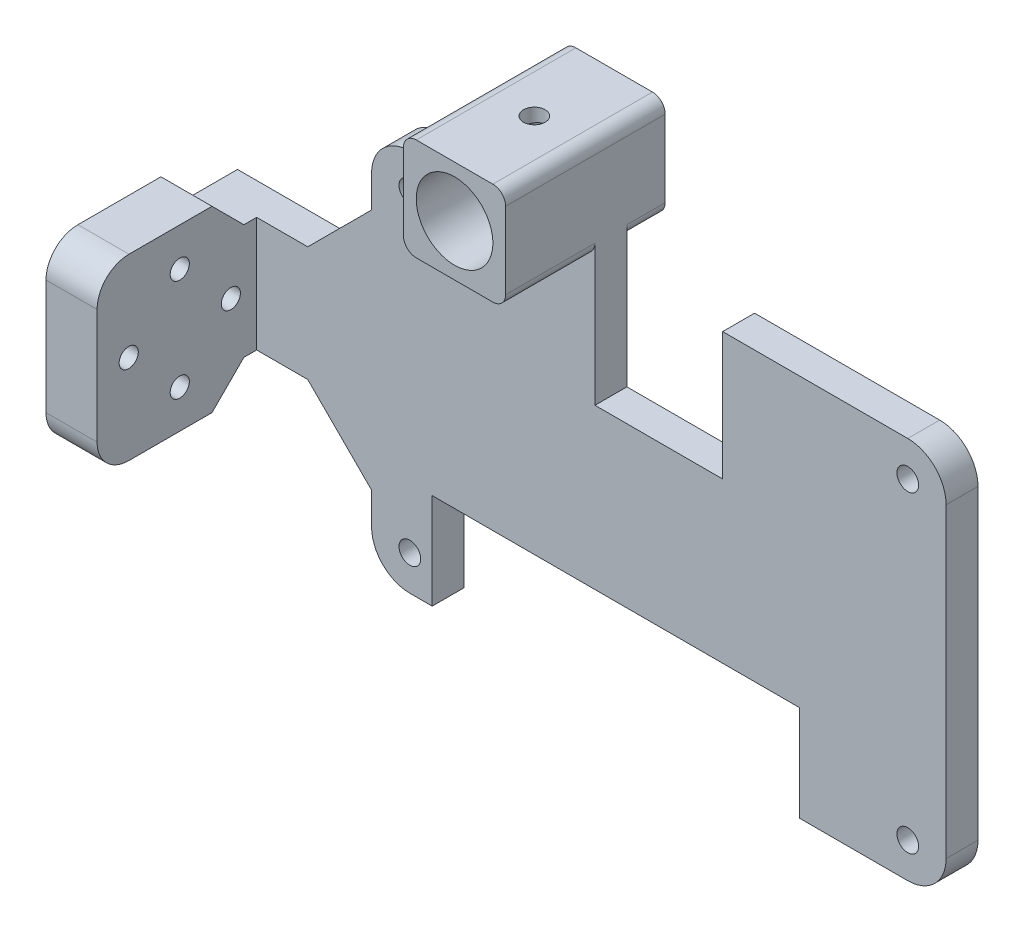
from build123d import *

# Parameters (mm, degrees)
SKETCH_2_W          = 90
SKETCH_2_H          = 60
EXTRUDE_1_DEPTH     = 5
SKETCH_3_R          = 1.7
CUT_EXTRUDE_1_DEPTH = 55.313902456
FILLET_1_R          = 6
SKETCH_9_W          = 20
SKETCH_9_H          = 20
SKETCH_9_W_2        = 57.5
SKETCH_9_H_2        = 15
CUT_EXTRUDE_2_DEPTH = 55.313902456
SKETCH_11_W         = 5
SKETCH_11_H         = 18
EXTRUDE_2_DEPTH     = 26
RIB_1_REACH         = 79.24
SKETCH_12_WALL_W    = 170.621907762
SKETCH_12_WALL_H    = 5
SKETCH_13_W         = 8
SKETCH_13_H         = 18
EXTRUDE_3_DEPTH     = 25
SKETCH_18_W         = 8
SKETCH_18_H         = 18
EXTRUDE_5_DEPTH     = 5
SKETCH_19_R         = 1.5
CUT_EXTRUDE_4_DEPTH = 124.515181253
EXTRUDE_6_DEPTH     = 8
FILLET_2_R          = 5
SKETCH_22_W         = 16
SKETCH_22_H         = 25
EXTRUDE_9_DEPTH     = 16
RIB_5_REACH         = 85.576
SKETCH_26_WALL_W    = 177.637906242
SKETCH_26_WALL_H    = 6
SKETCH_27_R         = 6
CUT_EXTRUDE_5_DEPTH = 92.940197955
FILLET_8_R          = 2
SKETCH_28_R         = 1.7
CUT_EXTRUDE_6_DEPTH = 10


with BuildPart() as part:
    # Sketch 2 → Extrude 1 (new body)
    with BuildSketch(Plane.XY):
        Rectangle(SKETCH_2_W, SKETCH_2_H)
    extrude(amount=EXTRUDE_1_DEPTH)

    # Sketch 3 → Cut-Extrude 1 (cut, through all)
    with BuildSketch(Plane(origin=(0, 0, 0), x_dir=(-1, 0, 0), z_dir=(0, 0, -1))):
        with Locations((-39, 24.5)):
            Circle(SKETCH_3_R)
        with Locations((39, 24.5)):
            Circle(SKETCH_3_R)
    cut_extrude_1 = extrude(amount=-CUT_EXTRUDE_1_DEPTH, mode=Mode.SUBTRACT)

    # Mirror 1: Cut-Extrude 1 across plane
    add(cut_extrude_1.mirror(Plane.ZX), mode=Mode.SUBTRACT)

    # Fillet 1
    fillet_1_edges = [part.edges().sort_by_distance(p)[0] for p in [
        (45, -30, 2.5),
        (-45, -30, 2.5),
        (-45, 30, 2.5),
        (45, 30, 2.5),
    ]]
    fillet(fillet_1_edges, radius=FILLET_1_R)

    # Sketch 9 → Cut-Extrude 2 (cut, through all)
    with BuildSketch(Plane(origin=(0, 0, 0), x_dir=(-1, 0, 0), z_dir=(0, 0, -1))):
        with Locations((0, 20)):
            Rectangle(SKETCH_9_W, SKETCH_9_H)
        with Locations((6.75, -22.5)):
            Rectangle(SKETCH_9_W_2, SKETCH_9_H_2)
    extrude(amount=-CUT_EXTRUDE_2_DEPTH, mode=Mode.SUBTRACT)

    # Sketch 11 → Extrude 2 (add)
    with BuildSketch(Plane.ZY.offset(45)):
        with Locations((2.5, 0)):
            Rectangle(SKETCH_11_W, SKETCH_11_H)
    extrude(amount=EXTRUDE_2_DEPTH)

    # Sketch 12 wall → Rib 1 (add, up to next)
    with BuildSketch(Plane(origin=(-50, 14, 0), x_dir=(-0.707106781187, -0.707106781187, 0), z_dir=(-0.707106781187, 0.707106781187, 0)), mode=Mode.PRIVATE) as rib_1_sk1:
        with Locations((0, 2.5)):
            Rectangle(SKETCH_12_WALL_W, SKETCH_12_WALL_H)
    rib_1_tool1 = extrude(rib_1_sk1.sketch, amount=-RIB_1_REACH, mode=Mode.PRIVATE) - part.part
    rib_1 = rib_1_tool1.solids().sort_by_distance((-50, 14, 0))[0]
    add(rib_1)

    # Mirror 2: Rib 1 across plane
    add(rib_1.mirror(Plane.ZX))

    # Sketch 13 → Extrude 3 (add)
    with BuildSketch(Plane.XY.offset(5)):
        with Locations((-67, 0)):
            Rectangle(SKETCH_13_W, SKETCH_13_H)
    extrude(amount=EXTRUDE_3_DEPTH)

    # Sketch 18 → Extrude 5 (add)
    with BuildSketch(Plane(origin=(0, 9, 0), x_dir=(1, 0, 0), z_dir=(0, 1, 0))):
        with Locations((-67, -21)):
            Rectangle(SKETCH_18_W, SKETCH_18_H)
    extrude_5 = extrude(amount=EXTRUDE_5_DEPTH)

    # Mirror 5: Extrude 5 across plane
    add(extrude_5.mirror(Plane.ZX))

    # Sketch 19 → Cut-Extrude 4 (cut, through all)
    with BuildSketch(Plane.ZY.offset(71)):
        with Locations((17.043478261, 8)):
            Circle(SKETCH_19_R)
        with Locations((25.043478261, 0)):
            Circle(SKETCH_19_R)
        with Locations((17.043478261, -8)):
            Circle(SKETCH_19_R)
        with Locations((9.043478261, 0)):
            Circle(SKETCH_19_R)
    extrude(amount=-CUT_EXTRUDE_4_DEPTH, mode=Mode.SUBTRACT)

    # Sketch 21 → Extrude 6 (add)
    with BuildSketch(Plane.ZY.offset(71)):
        Polygon((12, 14), (7, 9), (12, 9), align=None)
    extrude_6 = extrude(amount=-EXTRUDE_6_DEPTH)

    # Mirror 6: Extrude 6 across plane
    add(extrude_6.mirror(Plane.ZX))

    # Fillet 2
    fillet_2_edges = [part.edges().sort_by_distance(p)[0] for p in [
        (-67, 14, 30),
        (-67, -14, 30),
    ]]
    fillet(fillet_2_edges, radius=FILLET_2_R)

    # Sketch 22 → Extrude 9 (add)
    with BuildSketch(Plane(origin=(0, 30, 0), x_dir=(1, 0, 0), z_dir=(0, 1, 0))):
        with Locations((-18, -6.5)):
            Rectangle(SKETCH_22_W, SKETCH_22_H)
    extrude(amount=EXTRUDE_9_DEPTH)

    # Sketch 26 wall → Rib 5 (add, up to next)
    with BuildSketch(Plane(origin=(-18, 27, -3), x_dir=(0, -0.707106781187, 0.707106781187), z_dir=(0, -0.707106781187, -0.707106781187)), mode=Mode.PRIVATE) as rib_5_sk1:
        Rectangle(SKETCH_26_WALL_W, SKETCH_26_WALL_H)
    rib_5_tool1 = extrude(rib_5_sk1.sketch, amount=-RIB_5_REACH, mode=Mode.PRIVATE) - part.part
    add(rib_5_tool1.solids().sort_by_distance((-18, 27, -3))[0])

    # Sketch 27 → Cut-Extrude 5 (cut, through all)
    with BuildSketch(Plane(origin=(0, 0, -6), x_dir=(-1, 0, 0), z_dir=(0, 0, -1))):
        with Locations((18, 38)):
            Circle(SKETCH_27_R)
    extrude(amount=-CUT_EXTRUDE_5_DEPTH, mode=Mode.SUBTRACT)

    # Fillet 8
    fillet_8_edges = [part.edges().sort_by_distance(p)[0] for p in [
        (-10, 30, 12),
        (-10, 30, -3),
        (-26, 30, -3),
        (-26, 30, 12),
        (-10, 46, 6.5),
        (-26, 46, 6.5),
    ]]
    fillet(fillet_8_edges, radius=FILLET_8_R)

    # Sketch 28 → Cut-Extrude 6 (cut)
    with BuildSketch(Plane(origin=(0, 46, 0), x_dir=(1, 0, 0), z_dir=(0, 1, 0))):
        with Locations(Location((-18, -6.5, 0), (0, 0, 270))):
            Circle(SKETCH_28_R)
    extrude(amount=-CUT_EXTRUDE_6_DEPTH, mode=Mode.SUBTRACT)


solid = part.part
